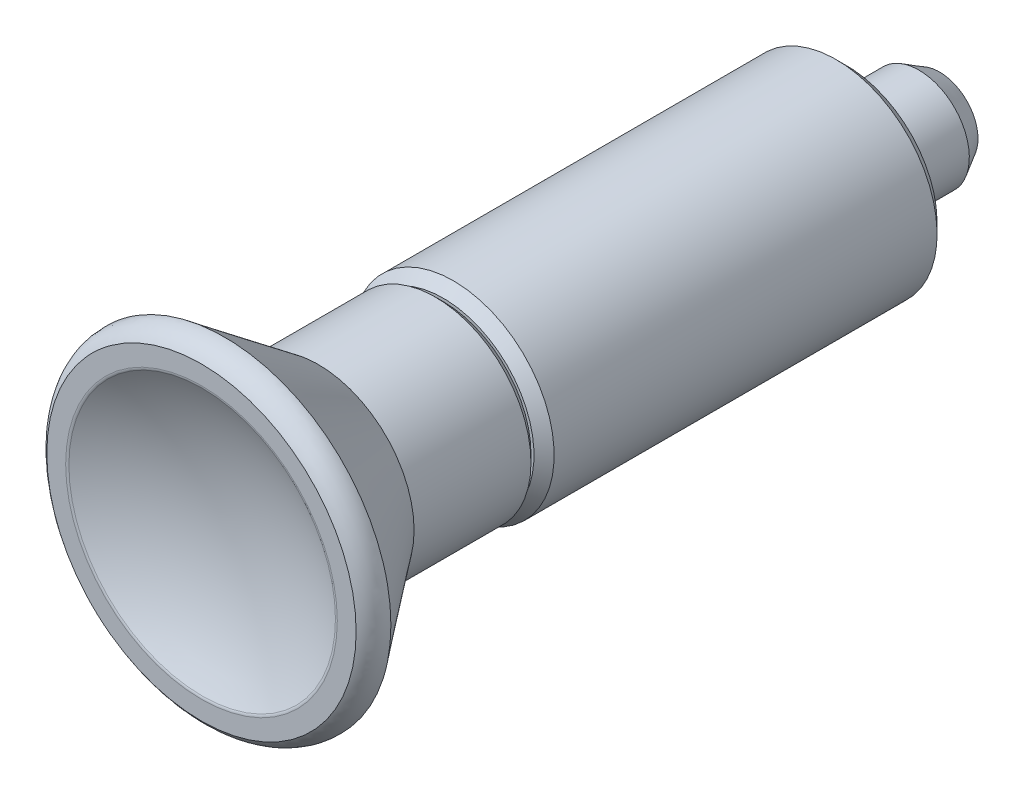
ISO-10303-21;
HEADER;
FILE_DESCRIPTION(('STEP AP214'),'2;1');
FILE_NAME('part.step','',(''),(''),'','','');
FILE_SCHEMA(('AUTOMOTIVE_DESIGN { 1 0 10303 214 1 1 1 1 }'));
ENDSEC;
DATA;
#1=APPLICATION_CONTEXT('core data for automotive mechanical design processes');
#2=APPLICATION_PROTOCOL_DEFINITION('international standard','automotive_design',2000,#1);
#3=PRODUCT_CONTEXT('',#1,'mechanical');
#4=PRODUCT('Part','Part','',(#3));
#5=PRODUCT_RELATED_PRODUCT_CATEGORY('part','',(#4));
#6=PRODUCT_DEFINITION_FORMATION('','',#4);
#7=PRODUCT_DEFINITION_CONTEXT('part definition',#1,'design');
#8=PRODUCT_DEFINITION('design','',#6,#7);
#9=PRODUCT_DEFINITION_SHAPE('','',#8);
#10=(LENGTH_UNIT() NAMED_UNIT(*) SI_UNIT(.MILLI.,.METRE.));
#11=(NAMED_UNIT(*) PLANE_ANGLE_UNIT() SI_UNIT($,.RADIAN.));
#12=(NAMED_UNIT(*) SI_UNIT($,.STERADIAN.) SOLID_ANGLE_UNIT());
#13=UNCERTAINTY_MEASURE_WITH_UNIT(LENGTH_MEASURE(1.E-05),#10,'distance_accuracy_value','');
#14=(GEOMETRIC_REPRESENTATION_CONTEXT(3) GLOBAL_UNCERTAINTY_ASSIGNED_CONTEXT((#13)) GLOBAL_UNIT_ASSIGNED_CONTEXT((#10,
#11,#12)) REPRESENTATION_CONTEXT('',''));
#15=CARTESIAN_POINT('',(0.,0.,0.));
#16=DIRECTION('',(0.,0.,1.));
#17=DIRECTION('',(1.,0.,0.));
#18=AXIS2_PLACEMENT_3D('',#15,#16,#17);
#19=CARTESIAN_POINT('',(3.05742674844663E-10,5.05678832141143E-10,-8.26498591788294E-10));
#20=DIRECTION('',(-0.923728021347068,-0.383049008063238,0.));
#21=DIRECTION('',(0.,0.,-1.));
#22=AXIS2_PLACEMENT_3D('',#19,#20,#21);
#23=SPHERICAL_SURFACE('',#22,10.);
#24=CARTESIAN_POINT('',(0.,0.,-9.24093444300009));
#25=DIRECTION('',(0.,0.,1.));
#26=DIRECTION('',(0.923728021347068,0.383049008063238,0.));
#27=AXIS2_PLACEMENT_3D('',#24,#25,#26);
#28=CIRCLE('',#27,3.82166595);
#29=CARTESIAN_POINT('',(3.53017992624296,1.46388535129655,-9.24093444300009));
#30=VERTEX_POINT('',#29);
#31=EDGE_CURVE('E39',#30,#30,#28,.T.);
#32=ORIENTED_EDGE('',*,*,#31,.F.);
#33=EDGE_LOOP('',(#32));
#34=FACE_BOUND('',#33,.T.);
#35=ADVANCED_FACE('F12',(#34),#23,.T.);
#36=CARTESIAN_POINT('',(0.,0.,-9.24093444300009));
#37=DIRECTION('',(0.,0.,1.));
#38=DIRECTION('',(0.923728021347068,0.383049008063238,0.));
#39=AXIS2_PLACEMENT_3D('',#36,#37,#38);
#40=CONICAL_SURFACE('',#39,3.82166595,0.523598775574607);
#41=CARTESIAN_POINT('',(0.,0.,-7.2));
#42=DIRECTION('',(0.,0.,-1.));
#43=DIRECTION('',(-0.923728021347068,-0.383049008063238,0.));
#44=AXIS2_PLACEMENT_3D('',#41,#42,#43);
#45=CIRCLE('',#44,5.);
#46=CARTESIAN_POINT('',(-4.61864010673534,-1.91524504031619,-7.2));
#47=VERTEX_POINT('',#46);
#48=EDGE_CURVE('E32',#47,#47,#45,.F.);
#49=ORIENTED_EDGE('',*,*,#48,.F.);
#50=EDGE_LOOP('',(#49));
#51=FACE_BOUND('',#50,.T.);
#52=ORIENTED_EDGE('',*,*,#31,.T.);
#53=EDGE_LOOP('',(#52));
#54=FACE_BOUND('',#53,.T.);
#55=ADVANCED_FACE('F80',(#51,#54),#40,.T.);
#56=CARTESIAN_POINT('',(0.,0.,0.));
#57=DIRECTION('',(0.,0.,-1.));
#58=DIRECTION('',(-0.923728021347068,-0.383049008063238,0.));
#59=AXIS2_PLACEMENT_3D('',#56,#57,#58);
#60=CYLINDRICAL_SURFACE('',#59,5.);
#61=ORIENTED_EDGE('',*,*,#48,.T.);
#62=EDGE_LOOP('',(#61));
#63=FACE_BOUND('',#62,.T.);
#64=CARTESIAN_POINT('',(0.,0.,0.));
#65=DIRECTION('',(0.,0.,-1.));
#66=DIRECTION('',(-0.923728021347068,-0.383049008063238,0.));
#67=AXIS2_PLACEMENT_3D('',#64,#65,#66);
#68=CIRCLE('',#67,5.);
#69=CARTESIAN_POINT('',(-4.61864010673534,-1.91524504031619,0.));
#70=VERTEX_POINT('',#69);
#71=EDGE_CURVE('E37',#70,#70,#68,.T.);
#72=ORIENTED_EDGE('',*,*,#71,.T.);
#73=EDGE_LOOP('',(#72));
#74=FACE_BOUND('',#73,.T.);
#75=ADVANCED_FACE('F87',(#63,#74),#60,.T.);
#76=CARTESIAN_POINT('',(-4.91249956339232,-11.9310751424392,0.));
#77=DIRECTION('',(0.,0.,1.));
#78=DIRECTION('',(0.923728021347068,0.383049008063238,0.));
#79=AXIS2_PLACEMENT_3D('',#76,#77,#78);
#80=PLANE('',#79);
#81=ORIENTED_EDGE('',*,*,#71,.F.);
#82=EDGE_LOOP('',(#81));
#83=FACE_BOUND('',#82,.T.);
#84=CARTESIAN_POINT('',(0.,0.,0.));
#85=DIRECTION('',(0.,0.,1.));
#86=DIRECTION('',(0.923728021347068,0.383049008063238,0.));
#87=AXIS2_PLACEMENT_3D('',#84,#85,#86);
#88=CIRCLE('',#87,9.);
#89=CARTESIAN_POINT('',(8.31355219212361,3.44744107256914,0.));
#90=VERTEX_POINT('',#89);
#91=EDGE_CURVE('E34',#90,#90,#88,.T.);
#92=ORIENTED_EDGE('',*,*,#91,.F.);
#93=EDGE_LOOP('',(#92));
#94=FACE_BOUND('',#93,.T.);
#95=ADVANCED_FACE('F91',(#83,#94),#80,.F.);
#96=CARTESIAN_POINT('',(0.,0.,0.));
#97=DIRECTION('',(0.,0.,1.));
#98=DIRECTION('',(0.923728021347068,0.383049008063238,0.));
#99=AXIS2_PLACEMENT_3D('',#96,#97,#98);
#100=CONICAL_SURFACE('',#99,9.,0.785398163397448);
#101=CARTESIAN_POINT('',(0.,0.,1.));
#102=DIRECTION('',(0.,0.,-1.));
#103=DIRECTION('',(-0.923728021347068,-0.383049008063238,0.));
#104=AXIS2_PLACEMENT_3D('',#101,#102,#103);
#105=CIRCLE('',#104,10.);
#106=CARTESIAN_POINT('',(-9.23728021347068,-3.83049008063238,0.999999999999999));
#107=VERTEX_POINT('',#106);
#108=EDGE_CURVE('E28',#107,#107,#105,.F.);
#109=ORIENTED_EDGE('',*,*,#108,.F.);
#110=EDGE_LOOP('',(#109));
#111=FACE_BOUND('',#110,.T.);
#112=ORIENTED_EDGE('',*,*,#91,.T.);
#113=EDGE_LOOP('',(#112));
#114=FACE_BOUND('',#113,.T.);
#115=ADVANCED_FACE('F93',(#111,#114),#100,.T.);
#116=CARTESIAN_POINT('',(0.,0.,39.));
#117=DIRECTION('',(0.,0.,-1.));
#118=DIRECTION('',(0.383049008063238,-0.923728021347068,0.));
#119=AXIS2_PLACEMENT_3D('',#116,#117,#118);
#120=CYLINDRICAL_SURFACE('',#119,10.);
#121=ORIENTED_EDGE('',*,*,#108,.T.);
#122=EDGE_LOOP('',(#121));
#123=FACE_BOUND('',#122,.T.);
#124=CARTESIAN_POINT('',(0.,0.,39.));
#125=DIRECTION('',(0.,0.,-1.));
#126=DIRECTION('',(-0.923728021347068,-0.383049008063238,0.));
#127=AXIS2_PLACEMENT_3D('',#124,#125,#126);
#128=CIRCLE('',#127,10.);
#129=CARTESIAN_POINT('',(-9.23728021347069,-3.83049008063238,39.));
#130=VERTEX_POINT('',#129);
#131=EDGE_CURVE('E23',#130,#130,#128,.F.);
#132=ORIENTED_EDGE('',*,*,#131,.F.);
#133=EDGE_LOOP('',(#132));
#134=FACE_BOUND('',#133,.T.);
#135=ADVANCED_FACE('F96',(#123,#134),#120,.T.);
#136=CARTESIAN_POINT('',(0.,0.,40.));
#137=DIRECTION('',(0.,0.,-1.));
#138=DIRECTION('',(0.383049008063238,-0.923728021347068,0.));
#139=AXIS2_PLACEMENT_3D('',#136,#137,#138);
#140=CONICAL_SURFACE('',#139,9.,0.785398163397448);
#141=ORIENTED_EDGE('',*,*,#131,.T.);
#142=EDGE_LOOP('',(#141));
#143=FACE_BOUND('',#142,.T.);
#144=CARTESIAN_POINT('',(0.,0.,40.));
#145=DIRECTION('',(0.,0.,-1.));
#146=DIRECTION('',(0.383049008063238,-0.923728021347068,0.));
#147=AXIS2_PLACEMENT_3D('',#144,#145,#146);
#148=CIRCLE('',#147,9.);
#149=CARTESIAN_POINT('',(3.44744107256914,-8.31355219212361,40.));
#150=VERTEX_POINT('',#149);
#151=EDGE_CURVE('E19',#150,#150,#148,.T.);
#152=ORIENTED_EDGE('',*,*,#151,.T.);
#153=EDGE_LOOP('',(#152));
#154=FACE_BOUND('',#153,.T.);
#155=ADVANCED_FACE('F100',(#143,#154),#140,.T.);
#156=CARTESIAN_POINT('',(11.9141300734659,-4.95345441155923,40.));
#157=DIRECTION('',(0.,0.,-1.));
#158=DIRECTION('',(-0.923728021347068,-0.383049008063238,0.));
#159=AXIS2_PLACEMENT_3D('',#156,#157,#158);
#160=PLANE('',#159);
#161=CARTESIAN_POINT('',(0.,0.,40.));
#162=DIRECTION('',(0.,0.,-1.));
#163=DIRECTION('',(-1.,0.,0.));
#164=AXIS2_PLACEMENT_3D('',#161,#162,#163);
#165=CIRCLE('',#164,8.7);
#166=CARTESIAN_POINT('',(-8.70000000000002,0.,40.));
#167=VERTEX_POINT('',#166);
#168=EDGE_CURVE('E8',#167,#167,#165,.T.);
#169=ORIENTED_EDGE('',*,*,#168,.T.);
#170=EDGE_LOOP('',(#169));
#171=FACE_BOUND('',#170,.T.);
#172=ORIENTED_EDGE('',*,*,#151,.F.);
#173=EDGE_LOOP('',(#172));
#174=FACE_BOUND('',#173,.T.);
#175=ADVANCED_FACE('F104',(#171,#174),#160,.F.);
#176=CARTESIAN_POINT('',(-7.38399959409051E-13,0.,86.3153369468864));
#177=DIRECTION('',(0.,0.,-1.));
#178=DIRECTION('',(1.,0.,0.));
#179=AXIS2_PLACEMENT_3D('',#176,#177,#178);
#180=SPHERICAL_SURFACE('',#179,25.9999999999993);
#181=CARTESIAN_POINT('',(0.,0.,63.9304780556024));
#182=DIRECTION('',(0.,0.,-1.));
#183=DIRECTION('',(1.,0.,0.));
#184=AXIS2_PLACEMENT_3D('',#181,#182,#183);
#185=CIRCLE('',#184,13.2256603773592);
#186=CARTESIAN_POINT('',(13.2256603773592,0.,63.9304780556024));
#187=VERTEX_POINT('',#186);
#188=EDGE_CURVE('E71',#187,#187,#185,.T.);
#189=ORIENTED_EDGE('',*,*,#188,.F.);
#190=EDGE_LOOP('',(#189));
#191=FACE_BOUND('',#190,.T.);
#192=ADVANCED_FACE('F83',(#191),#180,.F.);
#193=CARTESIAN_POINT('',(0.,0.,63.5000000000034));
#194=DIRECTION('',(0.,0.,-1.));
#195=DIRECTION('',(-1.,0.,0.));
#196=AXIS2_PLACEMENT_3D('',#193,#194,#195);
#197=TOROIDAL_SURFACE('',#196,13.4799999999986,0.499999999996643);
#198=ORIENTED_EDGE('',*,*,#188,.T.);
#199=EDGE_LOOP('',(#198));
#200=FACE_BOUND('',#199,.T.);
#201=CARTESIAN_POINT('',(0.,0.,64.));
#202=DIRECTION('',(0.,0.,-1.));
#203=DIRECTION('',(1.,0.,0.));
#204=AXIS2_PLACEMENT_3D('',#201,#202,#203);
#205=CIRCLE('',#204,13.48);
#206=CARTESIAN_POINT('',(13.48,0.,64.));
#207=VERTEX_POINT('',#206);
#208=EDGE_CURVE('E64',#207,#207,#205,.T.);
#209=ORIENTED_EDGE('',*,*,#208,.F.);
#210=EDGE_LOOP('',(#209));
#211=FACE_BOUND('',#210,.T.);
#212=ADVANCED_FACE('F14',(#200,#211),#197,.T.);
#213=CARTESIAN_POINT('',(-16.885,-16.885,64.));
#214=DIRECTION('',(0.,0.,1.));
#215=DIRECTION('',(1.,0.,0.));
#216=AXIS2_PLACEMENT_3D('',#213,#214,#215);
#217=PLANE('',#216);
#218=CARTESIAN_POINT('',(0.,0.,64.));
#219=DIRECTION('',(0.,0.,-1.));
#220=DIRECTION('',(1.,0.,0.));
#221=AXIS2_PLACEMENT_3D('',#218,#219,#220);
#222=CIRCLE('',#221,15.35);
#223=CARTESIAN_POINT('',(15.35,0.,64.));
#224=VERTEX_POINT('',#223);
#225=EDGE_CURVE('E57',#224,#224,#222,.T.);
#226=ORIENTED_EDGE('',*,*,#225,.F.);
#227=EDGE_LOOP('',(#226));
#228=FACE_BOUND('',#227,.T.);
#229=ORIENTED_EDGE('',*,*,#208,.T.);
#230=EDGE_LOOP('',(#229));
#231=FACE_BOUND('',#230,.T.);
#232=ADVANCED_FACE('F121',(#228,#231),#217,.T.);
#233=CARTESIAN_POINT('',(15.35,0.,64.));
#234=CARTESIAN_POINT('',(16.6156543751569,0.,63.1898669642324));
#235=CARTESIAN_POINT('',(16.5,0.,61.7));
#236=CARTESIAN_POINT('',(15.35,-26.5869798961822,64.));
#237=CARTESIAN_POINT('',(16.6156543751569,-28.779157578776,63.1898669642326));
#238=CARTESIAN_POINT('',(16.5,-28.5788383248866,61.7));
#239=CARTESIAN_POINT('',(-7.675,-13.2934899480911,64.));
#240=CARTESIAN_POINT('',(-8.30782718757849,-14.389578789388,63.1898669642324));
#241=CARTESIAN_POINT('',(-8.25,-14.2894191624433,61.7));
#242=CARTESIAN_POINT('',(-30.7,0.,64.));
#243=CARTESIAN_POINT('',(-33.2313087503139,0.,63.1898669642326));
#244=CARTESIAN_POINT('',(-33.,0.,61.7));
#245=CARTESIAN_POINT('',(-7.675,13.2934899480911,64.));
#246=CARTESIAN_POINT('',(-8.30782718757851,14.389578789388,63.1898669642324));
#247=CARTESIAN_POINT('',(-8.25,14.2894191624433,61.7));
#248=CARTESIAN_POINT('',(15.35,26.5869798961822,64.));
#249=CARTESIAN_POINT('',(16.6156543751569,28.779157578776,63.1898669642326));
#250=CARTESIAN_POINT('',(16.5,28.5788383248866,61.7));
#251=CARTESIAN_POINT('',(15.35,0.,64.));
#252=CARTESIAN_POINT('',(16.6156543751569,0.,63.1898669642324));
#253=CARTESIAN_POINT('',(16.5,0.,61.7));
#254=(BOUNDED_SURFACE() B_SPLINE_SURFACE(2,2,((#233,#234,#235),(#236,#237,#238),(#239,#240,
#241),(#242,#243,#244),(#245,#246,#247),(#248,#249,#250),(#251,#252,#253)),.UNSPECIFIED.,.T.,
.F.,.F.) B_SPLINE_SURFACE_WITH_KNOTS((3,2,2,3),(3,3),(0.,18.7749492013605,37.5498984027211,
56.3248476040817),(0.,1.),
.UNSPECIFIED.) GEOMETRIC_REPRESENTATION_ITEM() RATIONAL_B_SPLINE_SURFACE(((1.,0.857079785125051,
1.),(0.5,0.428539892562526,0.5),(1.,0.857079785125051,1.),(0.5,0.428539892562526,0.5),(1.,
0.857079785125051,1.),(0.5,0.428539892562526,0.5),(1.,0.857079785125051,1.))) REPRESENTATION_ITEM('') SURFACE());
#255=CARTESIAN_POINT('',(0.,0.,61.7));
#256=DIRECTION('',(0.,0.,1.));
#257=DIRECTION('',(1.,0.,0.));
#258=AXIS2_PLACEMENT_3D('',#255,#256,#257);
#259=CIRCLE('',#258,16.5);
#260=CARTESIAN_POINT('',(16.5,0.,61.7));
#261=VERTEX_POINT('',#260);
#262=EDGE_CURVE('E60',#261,#261,#259,.T.);
#263=CARTESIAN_POINT('',(15.35,0.,64.));
#264=CARTESIAN_POINT('',(15.3556561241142,0.,63.9963795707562));
#265=CARTESIAN_POINT('',(15.3612977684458,0.,63.992736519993));
#266=CARTESIAN_POINT('',(15.3725641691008,0.,63.9853973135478));
#267=CARTESIAN_POINT('',(15.3781888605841,0.,63.9817010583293));
#268=CARTESIAN_POINT('',(15.3894206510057,0.,63.9742554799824));
#269=CARTESIAN_POINT('',(15.395027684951,0.,63.9705060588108));
#270=CARTESIAN_POINT('',(15.4062234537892,0.,63.9629541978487));
#271=CARTESIAN_POINT('',(15.4118121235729,0.,63.9591516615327));
#272=CARTESIAN_POINT('',(15.4229704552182,0.,63.9514936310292));
#273=CARTESIAN_POINT('',(15.4285400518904,0.,63.9476380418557));
#274=CARTESIAN_POINT('',(15.4396595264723,0.,63.9398739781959));
#275=CARTESIAN_POINT('',(15.4452093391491,0.,63.9359654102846));
#276=CARTESIAN_POINT('',(15.4562885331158,0.,63.9280954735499));
#277=CARTESIAN_POINT('',(15.4618178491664,0.,63.9241340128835));
#278=CARTESIAN_POINT('',(15.4728553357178,0.,63.9161583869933));
#279=CARTESIAN_POINT('',(15.4783634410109,0.,63.9121441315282));
#280=CARTESIAN_POINT('',(15.489357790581,0.,63.9040630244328));
#281=CARTESIAN_POINT('',(15.4948439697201,0.,63.8999960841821));
#282=CARTESIAN_POINT('',(15.5057937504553,0.,63.8918097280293));
#283=CARTESIAN_POINT('',(15.5112572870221,0.,63.8876902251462));
#284=CARTESIAN_POINT('',(15.5221610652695,0.,63.8793988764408));
#285=CARTESIAN_POINT('',(15.527601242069,0.,63.8752269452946));
#286=CARTESIAN_POINT('',(15.538457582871,0.,63.8668308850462));
#287=CARTESIAN_POINT('',(15.5438736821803,0.,63.8626066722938));
#288=CARTESIAN_POINT('',(15.5546811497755,0.,63.8541062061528));
#289=CARTESIAN_POINT('',(15.5600724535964,0.,63.8498298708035));
#290=CARTESIAN_POINT('',(15.5708296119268,0.,63.8412253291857));
#291=CARTESIAN_POINT('',(15.5761954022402,0.,63.8368970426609));
#292=CARTESIAN_POINT('',(15.5869008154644,0.,63.8281887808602));
#293=CARTESIAN_POINT('',(15.592240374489,0.,63.8238087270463));
#294=CARTESIAN_POINT('',(15.6028926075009,0.,63.8149971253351));
#295=CARTESIAN_POINT('',(15.6082052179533,0.,63.810565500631));
#296=CARTESIAN_POINT('',(15.6188028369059,0.,63.8016509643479));
#297=CARTESIAN_POINT('',(15.6240877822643,0.,63.7971679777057));
#298=CARTESIAN_POINT('',(15.634629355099,0.,63.7881509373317));
#299=CARTESIAN_POINT('',(15.6398859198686,0.,63.783616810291));
#300=CARTESIAN_POINT('',(15.6503700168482,0.,63.7744977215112));
#301=CARTESIAN_POINT('',(15.655597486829,0.,63.7699126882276));
#302=CARTESIAN_POINT('',(15.6660226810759,0.,63.7606920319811));
#303=CARTESIAN_POINT('',(15.6712203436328,0.,63.7560563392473));
#304=CARTESIAN_POINT('',(15.6815852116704,0.,63.7467346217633));
#305=CARTESIAN_POINT('',(15.6867523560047,0.,63.742048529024));
#306=CARTESIAN_POINT('',(15.6970554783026,0.,63.732626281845));
#307=CARTESIAN_POINT('',(15.7021913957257,0.,63.7278900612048));
#308=CARTESIAN_POINT('',(15.7124313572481,0.,63.7183678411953));
#309=CARTESIAN_POINT('',(15.717535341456,0.,63.71358177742));
#310=CARTESIAN_POINT('',(15.7277107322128,0.,63.7039601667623));
#311=CARTESIAN_POINT('',(15.7327820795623,0.,63.6991245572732));
#312=CARTESIAN_POINT('',(15.7428914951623,0.,63.689404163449));
#313=CARTESIAN_POINT('',(15.7479295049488,0.,63.6845193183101));
#314=CARTESIAN_POINT('',(15.7579715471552,0.,63.6747007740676));
#315=CARTESIAN_POINT('',(15.7629755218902,0.,63.6697670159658));
#316=CARTESIAN_POINT('',(15.7729487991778,0.,63.6598509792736));
#317=CARTESIAN_POINT('',(15.7779180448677,0.,63.6548686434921));
#318=CARTESIAN_POINT('',(15.7878211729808,0.,63.6448557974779));
#319=CARTESIAN_POINT('',(15.7927549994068,0.,63.6398252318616));
#320=CARTESIAN_POINT('',(15.8025866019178,0.,63.6297162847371));
#321=CARTESIAN_POINT('',(15.8074843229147,0.,63.6246378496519));
#322=CARTESIAN_POINT('',(15.817243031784,0.,63.6144335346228));
#323=CARTESIAN_POINT('',(15.8221039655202,0.,63.6093076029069));
#324=CARTESIAN_POINT('',(15.8317884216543,0.,63.5990086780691));
#325=CARTESIAN_POINT('',(15.8366118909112,0.,63.5938356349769));
#326=CARTESIAN_POINT('',(15.8462207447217,0.,63.5834428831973));
#327=CARTESIAN_POINT('',(15.8510060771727,0.,63.5782231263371));
#328=CARTESIAN_POINT('',(15.8605379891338,0.,63.5677373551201));
#329=CARTESIAN_POINT('',(15.8652845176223,0.,63.5624712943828));
#330=CARTESIAN_POINT('',(15.8747381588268,0.,63.5518933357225));
#331=CARTESIAN_POINT('',(15.8794452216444,0.,63.5465813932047));
#332=CARTESIAN_POINT('',(15.8888192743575,0.,63.535912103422));
#333=CARTESIAN_POINT('',(15.8934862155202,0.,63.5305547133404));
#334=CARTESIAN_POINT('',(15.9027793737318,0.,63.5197949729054));
#335=CARTESIAN_POINT('',(15.9074055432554,0.,63.5143925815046));
#336=CARTESIAN_POINT('',(15.9166165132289,0.,63.5035432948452));
#337=CARTESIAN_POINT('',(15.9212012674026,0.,63.4980963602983));
#338=CARTESIAN_POINT('',(15.9303287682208,0.,63.4871584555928));
#339=CARTESIAN_POINT('',(15.9348714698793,0.,63.4816674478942));
#340=CARTESIAN_POINT('',(15.9439142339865,0.,63.4706418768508));
#341=CARTESIAN_POINT('',(15.9484142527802,0.,63.4651072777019));
#342=CARTESIAN_POINT('',(15.9573710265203,0.,63.4539950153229));
#343=CARTESIAN_POINT('',(15.9618277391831,0.,63.448417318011));
#344=CARTESIAN_POINT('',(15.9706972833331,0.,63.4372193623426));
#345=CARTESIAN_POINT('',(15.9751100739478,0.,63.4315990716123));
#346=CARTESIAN_POINT('',(15.9838911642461,0.,63.4203164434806));
#347=CARTESIAN_POINT('',(15.9882594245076,0.,63.4146540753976));
#348=CARTESIAN_POINT('',(15.9969508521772,0.,63.4032878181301));
#349=CARTESIAN_POINT('',(16.0012739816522,0.,63.3975838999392));
#350=CARTESIAN_POINT('',(16.0098745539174,0.,63.3861350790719));
#351=CARTESIAN_POINT('',(16.0141519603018,0.,63.3803901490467));
#352=CARTESIAN_POINT('',(16.0226605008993,0.,63.3688598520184));
#353=CARTESIAN_POINT('',(16.0268916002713,0.,63.3630744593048));
#354=CARTESIAN_POINT('',(16.035306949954,0.,63.3514637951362));
#355=CARTESIAN_POINT('',(16.0394911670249,0.,63.3456384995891));
#356=CARTESIAN_POINT('',(16.0478121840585,0.,63.3339485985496));
#357=CARTESIAN_POINT('',(16.0519489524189,0.,63.3280839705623));
#358=CARTESIAN_POINT('',(16.0601745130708,0.,63.3163159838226));
#359=CARTESIAN_POINT('',(16.0642632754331,0.,63.3104126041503));
#360=CARTESIAN_POINT('',(16.072392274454,0.,63.2985677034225));
#361=CARTESIAN_POINT('',(16.0764324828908,0.,63.2926261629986));
#362=CARTESIAN_POINT('',(16.0844638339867,0.,63.2807055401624));
#363=CARTESIAN_POINT('',(16.088454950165,0.,63.274726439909));
#364=CARTESIAN_POINT('',(16.0963875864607,0.,63.2627313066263));
#365=CARTESIAN_POINT('',(16.1003290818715,0.,63.256715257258));
#366=CARTESIAN_POINT('',(16.1081619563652,0.,63.2446468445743));
#367=CARTESIAN_POINT('',(16.1120533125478,0.,63.2385944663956));
#368=CARTESIAN_POINT('',(16.1197853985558,0.,63.2264540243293));
#369=CARTESIAN_POINT('',(16.1236261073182,0.,63.2203659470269));
#370=CARTESIAN_POINT('',(16.131256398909,0.,63.208154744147));
#371=CARTESIAN_POINT('',(16.1350459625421,0.,63.2020316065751));
#372=CARTESIAN_POINT('',(16.1425734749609,0.,63.189750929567));
#373=CARTESIAN_POINT('',(16.1463114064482,0.,63.1835933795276));
#374=CARTESIAN_POINT('',(16.15373517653,0.,63.1712445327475));
#375=CARTESIAN_POINT('',(16.1574209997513,0.,63.1650532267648));
#376=CARTESIAN_POINT('',(16.1647400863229,0.,63.1526375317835));
#377=CARTESIAN_POINT('',(16.1683733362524,0.,63.1464131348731));
#378=CARTESIAN_POINT('',(16.175586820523,0.,63.1339319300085));
#379=CARTESIAN_POINT('',(16.1791670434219,0.,63.1276751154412));
#380=CARTESIAN_POINT('',(16.1862740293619,0.,63.1151297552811));
#381=CARTESIAN_POINT('',(16.1898007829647,0.,63.1088412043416));
#382=CARTESIAN_POINT('',(16.196800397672,0.,63.0962330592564));
#383=CARTESIAN_POINT('',(16.2002732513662,0.,63.0899134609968));
#384=CARTESIAN_POINT('',(16.2071646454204,0.,63.0772439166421));
#385=CARTESIAN_POINT('',(16.210583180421,0.,63.0708939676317));
#386=CARTESIAN_POINT('',(16.2173655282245,0.,63.0581644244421));
#387=CARTESIAN_POINT('',(16.2207293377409,0.,63.0517848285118));
#388=CARTESIAN_POINT('',(16.2274018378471,0.,63.038996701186));
#389=CARTESIAN_POINT('',(16.2307105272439,0.,63.032588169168));
#390=CARTESIAN_POINT('',(16.237272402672,0.,63.0197428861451));
#391=CARTESIAN_POINT('',(16.2405255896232,0.,63.01330613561));
#392=CARTESIAN_POINT('',(16.2469760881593,0.,63.0004051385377));
#393=CARTESIAN_POINT('',(16.2501734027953,0.,62.993940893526));
#394=CARTESIAN_POINT('',(16.2565117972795,0.,62.9809856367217));
#395=CARTESIAN_POINT('',(16.2596528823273,0.,62.9744946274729));
#396=CARTESIAN_POINT('',(16.2658784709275,0.,62.9614865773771));
#397=CARTESIAN_POINT('',(16.2689629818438,0.,62.9549695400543));
#398=CARTESIAN_POINT('',(16.275075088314,0.,62.9419101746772));
#399=CARTESIAN_POINT('',(16.2781026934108,0.,62.9353678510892));
#400=CARTESIAN_POINT('',(16.2841006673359,0.,62.9222586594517));
#401=CARTESIAN_POINT('',(16.2870710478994,0.,62.9156917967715));
#402=CARTESIAN_POINT('',(16.2929542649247,0.,62.9025342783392));
#403=CARTESIAN_POINT('',(16.2958671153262,0.,62.89594362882));
#404=CARTESIAN_POINT('',(16.3016349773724,0.,62.8827392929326));
#405=CARTESIAN_POINT('',(16.3044900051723,0.,62.8761256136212));
#406=CARTESIAN_POINT('',(16.3101419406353,0.,62.8628759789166));
#407=CARTESIAN_POINT('',(16.3129388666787,0.,62.856240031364));
#408=CARTESIAN_POINT('',(16.3184743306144,0.,62.8429466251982));
#409=CARTESIAN_POINT('',(16.3212128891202,0.,62.8362891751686));
#410=CARTESIAN_POINT('',(16.3266313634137,0.,62.8229535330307));
#411=CARTESIAN_POINT('',(16.3293113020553,0.,62.8162753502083));
#412=CARTESIAN_POINT('',(16.3346122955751,0.,62.8028990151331));
#413=CARTESIAN_POINT('',(16.3372333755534,0.,62.7962008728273));
#414=CARTESIAN_POINT('',(16.3424164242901,0.,62.7827853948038));
#415=CARTESIAN_POINT('',(16.3449784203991,0.,62.7760680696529));
#416=CARTESIAN_POINT('',(16.3500430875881,0.,62.7626150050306));
#417=CARTESIAN_POINT('',(16.3525457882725,0.,62.7558792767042));
#418=CARTESIAN_POINT('',(16.357491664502,0.,62.7423901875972));
#419=CARTESIAN_POINT('',(16.3599348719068,0.,62.7356368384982));
#420=CARTESIAN_POINT('',(16.364761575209,0.,62.7221132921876));
#421=CARTESIAN_POINT('',(16.367145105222,0.,62.7153431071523));
#422=CARTESIAN_POINT('',(16.3718522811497,0.,62.7017866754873));
#423=CARTESIAN_POINT('',(16.3741759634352,0.,62.6950004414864));
#424=CARTESIAN_POINT('',(16.3787632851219,0.,62.6814127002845));
#425=CARTESIAN_POINT('',(16.3810269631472,0.,62.6746112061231));
#426=CARTESIAN_POINT('',(16.3854941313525,0.,62.6609937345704));
#427=CARTESIAN_POINT('',(16.3876976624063,0.,62.6541777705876));
#428=CARTESIAN_POINT('',(16.3920444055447,0.,62.6405321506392));
#429=CARTESIAN_POINT('',(16.3941876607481,0.,62.6337025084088));
#430=CARTESIAN_POINT('',(16.3984137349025,0.,62.6200303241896));
#431=CARTESIAN_POINT('',(16.4004965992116,0.,62.6131877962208));
#432=CARTESIAN_POINT('',(16.404601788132,0.,62.5994906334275));
#433=CARTESIAN_POINT('',(16.4066241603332,0.,62.5926360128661));
#434=CARTESIAN_POINT('',(16.4106082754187,0.,62.5789154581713));
#435=CARTESIAN_POINT('',(16.4125700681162,0.,62.5720495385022));
#436=CARTESIAN_POINT('',(16.4164329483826,0.,62.5583071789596));
#437=CARTESIAN_POINT('',(16.4183340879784,0.,62.5514307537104));
#438=CARTESIAN_POINT('',(16.4220756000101,0.,62.5376681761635));
#439=CARTESIAN_POINT('',(16.4239160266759,0.,62.5307820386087));
#440=CARTESIAN_POINT('',(16.4275360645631,0.,62.5170008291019));
#441=CARTESIAN_POINT('',(16.429315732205,0.,62.5101057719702));
#442=CARTESIAN_POINT('',(16.4328142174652,0.,62.4963075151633));
#443=CARTESIAN_POINT('',(16.4345330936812,0.,62.4894043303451));
#444=CARTESIAN_POINT('',(16.4379099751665,0.,62.4755906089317));
#445=CARTESIAN_POINT('',(16.4395680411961,0.,62.4686800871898));
#446=CARTESIAN_POINT('',(16.4428232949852,0.,62.4548524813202));
#447=CARTESIAN_POINT('',(16.4444205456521,0.,62.447935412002));
#448=CARTESIAN_POINT('',(16.4475541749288,0.,62.4340954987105));
#449=CARTESIAN_POINT('',(16.4490906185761,0.,62.4271726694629));
#450=CARTESIAN_POINT('',(16.4521026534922,0.,62.4133220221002));
#451=CARTESIAN_POINT('',(16.4535783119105,0.,62.4063942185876));
#452=CARTESIAN_POINT('',(16.4564688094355,0.,62.3925344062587));
#453=CARTESIAN_POINT('',(16.4578837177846,0.,62.385602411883));
#454=CARTESIAN_POINT('',(16.4606527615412,0.,62.3717349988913));
#455=CARTESIAN_POINT('',(16.4620069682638,0.,62.3647995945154));
#456=CARTESIAN_POINT('',(16.4646546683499,0.,62.3509261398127));
#457=CARTESIAN_POINT('',(16.4659482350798,0.,62.3439881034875));
#458=CARTESIAN_POINT('',(16.4684747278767,0.,62.3301101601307));
#459=CARTESIAN_POINT('',(16.4697077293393,0.,62.3231702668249));
#460=CARTESIAN_POINT('',(16.4721131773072,0.,62.3092893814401));
#461=CARTESIAN_POINT('',(16.4732857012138,0.,62.3023484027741));
#462=CARTESIAN_POINT('',(16.4755702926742,0.,62.2884661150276));
#463=CARTESIAN_POINT('',(16.4766824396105,0.,62.2815248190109));
#464=CARTESIAN_POINT('',(16.4788463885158,0.,62.2676426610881));
#465=CARTESIAN_POINT('',(16.4798982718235,0.,62.260701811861));
#466=CARTESIAN_POINT('',(16.4819418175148,0.,62.2468213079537));
#467=CARTESIAN_POINT('',(16.4829335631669,0.,62.2398816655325));
#468=CARTESIAN_POINT('',(16.4848569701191,0.,62.2260043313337));
#469=CARTESIAN_POINT('',(16.4857887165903,0.,62.2190666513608));
#470=CARTESIAN_POINT('',(16.487592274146,0.,62.2051939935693));
#471=CARTESIAN_POINT('',(16.4884641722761,0.,62.1982590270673));
#472=CARTESIAN_POINT('',(16.4901481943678,0.,62.1843925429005));
#473=CARTESIAN_POINT('',(16.4909604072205,0.,62.1774610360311));
#474=CARTESIAN_POINT('',(16.4925252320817,0.,62.1636022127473));
#475=CARTESIAN_POINT('',(16.4932779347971,0.,62.1566749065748));
#476=CARTESIAN_POINT('',(16.4947239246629,0.,62.1428252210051));
#477=CARTESIAN_POINT('',(16.4954173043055,0.,62.1359028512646));
#478=CARTESIAN_POINT('',(16.4967448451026,0.,62.1220637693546));
#479=CARTESIAN_POINT('',(16.4973791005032,0.,62.1151470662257));
#480=CARTESIAN_POINT('',(16.4985886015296,0.,62.101320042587));
#481=CARTESIAN_POINT('',(16.4991639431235,0.,62.0944097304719));
#482=CARTESIAN_POINT('',(16.5002558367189,0.,62.0805962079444));
#483=CARTESIAN_POINT('',(16.5007724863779,0.,62.0736930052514));
#484=CARTESIAN_POINT('',(16.5017472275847,0.,62.0598944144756));
#485=CARTESIAN_POINT('',(16.5022054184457,0.,62.0529990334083));
#486=CARTESIAN_POINT('',(16.5030634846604,0.,62.0392167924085));
#487=CARTESIAN_POINT('',(16.503463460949,0.,62.0323299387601));
#488=CARTESIAN_POINT('',(16.5042053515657,0.,62.0185654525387));
#489=CARTESIAN_POINT('',(16.5045473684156,0.,62.0116878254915));
#490=CARTESIAN_POINT('',(16.5051736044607,0.,61.9979424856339));
#491=CARTESIAN_POINT('',(16.5054579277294,0.,61.9910747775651));
#492=CARTESIAN_POINT('',(16.5059690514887,0.,61.9773499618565));
#493=CARTESIAN_POINT('',(16.5061959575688,0.,61.9704928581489));
#494=CARTESIAN_POINT('',(16.5065925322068,0.,61.9567899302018));
#495=CARTESIAN_POINT('',(16.506762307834,0.,61.9499441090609));
#496=CARTESIAN_POINT('',(16.5070449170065,0.,61.9362644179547));
#497=CARTESIAN_POINT('',(16.507157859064,0.,61.9294305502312));
#498=CARTESIAN_POINT('',(16.5073271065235,0.,61.9157754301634));
#499=CARTESIAN_POINT('',(16.5073835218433,0.,61.9089541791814));
#500=CARTESIAN_POINT('',(16.5074400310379,0.,61.8953249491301));
#501=CARTESIAN_POINT('',(16.5074402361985,0.,61.8885169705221));
#502=CARTESIAN_POINT('',(16.5073846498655,0.,61.874914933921));
#503=CARTESIAN_POINT('',(16.5073289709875,0.,61.8681208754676));
#504=CARTESIAN_POINT('',(16.5071619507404,0.,61.8545473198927));
#505=CARTESIAN_POINT('',(16.5070507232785,0.,61.8477678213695));
#506=CARTESIAN_POINT('',(16.5067729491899,0.,61.8342240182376));
#507=CARTESIAN_POINT('',(16.5066065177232,0.,61.827459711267));
#508=CARTESIAN_POINT('',(16.5062186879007,0.,61.8139469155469));
#509=CARTESIAN_POINT('',(16.5059974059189,0.,61.8071984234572));
#510=CARTESIAN_POINT('',(16.5055002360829,0.,61.7937178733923));
#511=CARTESIAN_POINT('',(16.5052244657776,0.,61.7869858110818));
#512=CARTESIAN_POINT('',(16.5046186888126,0.,61.7735387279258));
#513=CARTESIAN_POINT('',(16.504288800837,0.,61.7668237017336));
#514=CARTESIAN_POINT('',(16.503575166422,0.,61.7534112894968));
#515=CARTESIAN_POINT('',(16.503191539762,0.,61.7467138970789));
#516=CARTESIAN_POINT('',(16.5023708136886,0.,61.7333373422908));
#517=CARTESIAN_POINT('',(16.5019338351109,0.,61.7266581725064));
#518=CARTESIAN_POINT('',(16.5010067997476,0.,61.713318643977));
#519=CARTESIAN_POINT('',(16.5005168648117,0.,61.7066582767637));
#520=CARTESIAN_POINT('',(16.5,0.,61.7));
#521=B_SPLINE_CURVE_WITH_KNOTS('',3,(#263,#264,#265,#266,#267,#268,#269,#270,#271,#272,#273,
#274,#275,#276,#277,#278,#279,#280,#281,#282,#283,#284,#285,#286,#287,#288,#289,#290,#291,#292,
#293,#294,#295,#296,#297,#298,#299,#300,#301,#302,#303,#304,#305,#306,#307,#308,#309,#310,#311,
#312,#313,#314,#315,#316,#317,#318,#319,#320,#321,#322,#323,#324,#325,#326,#327,#328,#329,#330,
#331,#332,#333,#334,#335,#336,#337,#338,#339,#340,#341,#342,#343,#344,#345,#346,#347,#348,#349,
#350,#351,#352,#353,#354,#355,#356,#357,#358,#359,#360,#361,#362,#363,#364,#365,#366,#367,#368,
#369,#370,#371,#372,#373,#374,#375,#376,#377,#378,#379,#380,#381,#382,#383,#384,#385,#386,#387,
#388,#389,#390,#391,#392,#393,#394,#395,#396,#397,#398,#399,#400,#401,#402,#403,#404,#405,#406,
#407,#408,#409,#410,#411,#412,#413,#414,#415,#416,#417,#418,#419,#420,#421,#422,#423,#424,#425,
#426,#427,#428,#429,#430,#431,#432,#433,#434,#435,#436,#437,#438,#439,#440,#441,#442,#443,#444,
#445,#446,#447,#448,#449,#450,#451,#452,#453,#454,#455,#456,#457,#458,#459,#460,#461,#462,#463,
#464,#465,#466,#467,#468,#469,#470,#471,#472,#473,#474,#475,#476,#477,#478,#479,#480,#481,#482,
#483,#484,#485,#486,#487,#488,#489,#490,#491,#492,#493,#494,#495,#496,#497,#498,#499,#500,#501,
#502,#503,#504,#505,#506,#507,#508,#509,#510,#511,#512,#513,#514,#515,#516,#517,#518,#519,#520),
.UNSPECIFIED.,.F.,.F.,(4,2,2,2,2,2,2,2,2,2,2,2,2,2,2,2,2,2,2,2,2,2,2,2,2,2,2,2,2,2,2,2,2,2,2,2,
2,2,2,2,2,2,2,2,2,2,2,2,2,2,2,2,2,2,2,2,2,2,2,2,2,2,2,2,2,2,2,2,2,2,2,2,2,2,2,2,2,2,2,2,2,2,2,2,
2,2,2,2,2,2,2,2,2,2,2,2,2,2,2,2,2,2,2,2,2,2,2,2,2,2,2,2,2,2,2,2,2,2,2,2,2,2,2,2,2,2,2,2,4),(0.,
0.0201467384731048,0.0403379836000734,0.0605732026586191,0.080851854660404,0.101173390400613,
0.121537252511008,0.141942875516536,0.162389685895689,0.182877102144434,0.203404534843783,
0.223971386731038,0.244577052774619,0.265220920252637,0.285902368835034,0.306620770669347,
0.32737549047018,0.348165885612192,0.368991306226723,0.389851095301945,0.410744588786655,
0.43167111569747,0.452629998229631,0.473620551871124,0.494642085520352,0.515693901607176,
0.536775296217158,0.55788555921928,0.579023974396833,0.600189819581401,0.621382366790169,
0.64260088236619,0.663844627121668,0.68511285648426,0.706404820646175,0.727719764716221,
0.74905692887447,0.770415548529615,0.791794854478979,0.813194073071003,0.834612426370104,
0.85604913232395,0.877503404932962,0.898974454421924,0.920461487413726,0.941963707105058,
0.96348031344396,0.985010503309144,1.00655347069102,1.02810840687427,1.04967450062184,
1.07125093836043,1.09283690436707,1.11443158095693,1.13603414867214,1.15764378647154,
1.17925967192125,1.20088098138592,1.22250689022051,1.24413657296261,1.26576920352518,
1.28740395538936,1.30904000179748,1.33067651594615,1.35231267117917,1.37394764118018,
1.39558060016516,1.4172107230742,1.43883718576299,1.46045916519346,1.48207583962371,
1.50368638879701,1.52528999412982,1.54688583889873,1.56847310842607,1.59005099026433,
1.61161867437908,1.63317535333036,1.65472022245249,1.67625248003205,1.69777132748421,
1.71927596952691,1.74076561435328,1.76223947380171,1.78369676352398,1.80513670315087,
1.82655851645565,1.84796143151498,1.86934468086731,1.89070750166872,1.91204913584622,
1.93336883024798,1.95466583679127,1.97593941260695,1.99718882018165,2.01841332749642,
2.03961220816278,2.06078474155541,2.08193021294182,2.10304791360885,2.12413714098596,
2.1451971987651,2.16622739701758,2.18722705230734,2.20819548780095,2.22913203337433,
2.25003602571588,2.27090680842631,2.29174373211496,2.31254615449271,2.33331344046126,
2.3540449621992,2.37474009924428,2.3953982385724,2.41601877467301,2.43660110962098,
2.45714465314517,2.47764882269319,2.49811304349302,2.5185367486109,2.53891937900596,
2.55926038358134,2.57955921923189,2.59981535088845,2.6200282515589,2.64019740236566,
2.66032229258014,2.68040241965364,2.7004372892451),.UNSPECIFIED.);
#522=EDGE_CURVE('BSEAM128',#224,#261,#521,.T.);
#523=ORIENTED_EDGE('',*,*,#225,.T.);
#524=ORIENTED_EDGE('',*,*,#262,.T.);
#525=ORIENTED_EDGE('',*,*,#522,.T.);
#526=ORIENTED_EDGE('',*,*,#522,.F.);
#527=EDGE_LOOP('',(#523,#525,#524,#526));
#528=FACE_BOUND('',#527,.T.);
#529=ADVANCED_FACE('F128',(#528),#254,.T.);
#530=CARTESIAN_POINT('',(0.,0.,52.4));
#531=DIRECTION('',(0.,0.,1.));
#532=DIRECTION('',(1.,0.,0.));
#533=AXIS2_PLACEMENT_3D('',#530,#531,#532);
#534=CONICAL_SURFACE('',#533,9.5,0.645219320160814);
#535=ORIENTED_EDGE('',*,*,#262,.F.);
#536=EDGE_LOOP('',(#535));
#537=FACE_BOUND('',#536,.T.);
#538=CARTESIAN_POINT('',(0.,0.,52.4));
#539=DIRECTION('',(0.,0.,-1.));
#540=DIRECTION('',(1.,0.,0.));
#541=AXIS2_PLACEMENT_3D('',#538,#539,#540);
#542=CIRCLE('',#541,9.5);
#543=CARTESIAN_POINT('',(9.49999999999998,0.,52.4));
#544=VERTEX_POINT('',#543);
#545=EDGE_CURVE('E47',#544,#544,#542,.T.);
#546=ORIENTED_EDGE('',*,*,#545,.F.);
#547=EDGE_LOOP('',(#546));
#548=FACE_BOUND('',#547,.T.);
#549=ADVANCED_FACE('F134',(#537,#548),#534,.T.);
#550=CARTESIAN_POINT('',(0.,0.,52.4));
#551=DIRECTION('',(0.,0.,-1.));
#552=DIRECTION('',(1.,0.,0.));
#553=AXIS2_PLACEMENT_3D('',#550,#551,#552);
#554=CYLINDRICAL_SURFACE('',#553,9.5);
#555=CARTESIAN_POINT('',(0.,0.,40.8));
#556=DIRECTION('',(0.,0.,1.));
#557=DIRECTION('',(1.,0.,0.));
#558=AXIS2_PLACEMENT_3D('',#555,#556,#557);
#559=CIRCLE('',#558,9.5);
#560=CARTESIAN_POINT('',(9.49999999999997,0.,40.8));
#561=VERTEX_POINT('',#560);
#562=EDGE_CURVE('E41',#561,#561,#559,.T.);
#563=ORIENTED_EDGE('',*,*,#562,.T.);
#564=EDGE_LOOP('',(#563));
#565=FACE_BOUND('',#564,.T.);
#566=ORIENTED_EDGE('',*,*,#545,.T.);
#567=EDGE_LOOP('',(#566));
#568=FACE_BOUND('',#567,.T.);
#569=ADVANCED_FACE('F148',(#565,#568),#554,.T.);
#570=CARTESIAN_POINT('',(0.,0.,40.));
#571=DIRECTION('',(0.,0.,1.));
#572=DIRECTION('',(1.,0.,0.));
#573=AXIS2_PLACEMENT_3D('',#570,#571,#572);
#574=CONICAL_SURFACE('',#573,8.7,0.785398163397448);
#575=ORIENTED_EDGE('',*,*,#562,.F.);
#576=EDGE_LOOP('',(#575));
#577=FACE_BOUND('',#576,.T.);
#578=ORIENTED_EDGE('',*,*,#168,.F.);
#579=EDGE_LOOP('',(#578));
#580=FACE_BOUND('',#579,.T.);
#581=ADVANCED_FACE('F82',(#577,#580),#574,.T.);
#582=CLOSED_SHELL('',(#35,#55,#75,#95,#115,#135,#155,#175,#192,#212,#232,#529,#549,#569,#581));
#583=MANIFOLD_SOLID_BREP('B1',#582);
#584=ADVANCED_BREP_SHAPE_REPRESENTATION('',(#18,#583),#14);
#585=SHAPE_DEFINITION_REPRESENTATION(#9,#584);
ENDSEC;
END-ISO-10303-21;
